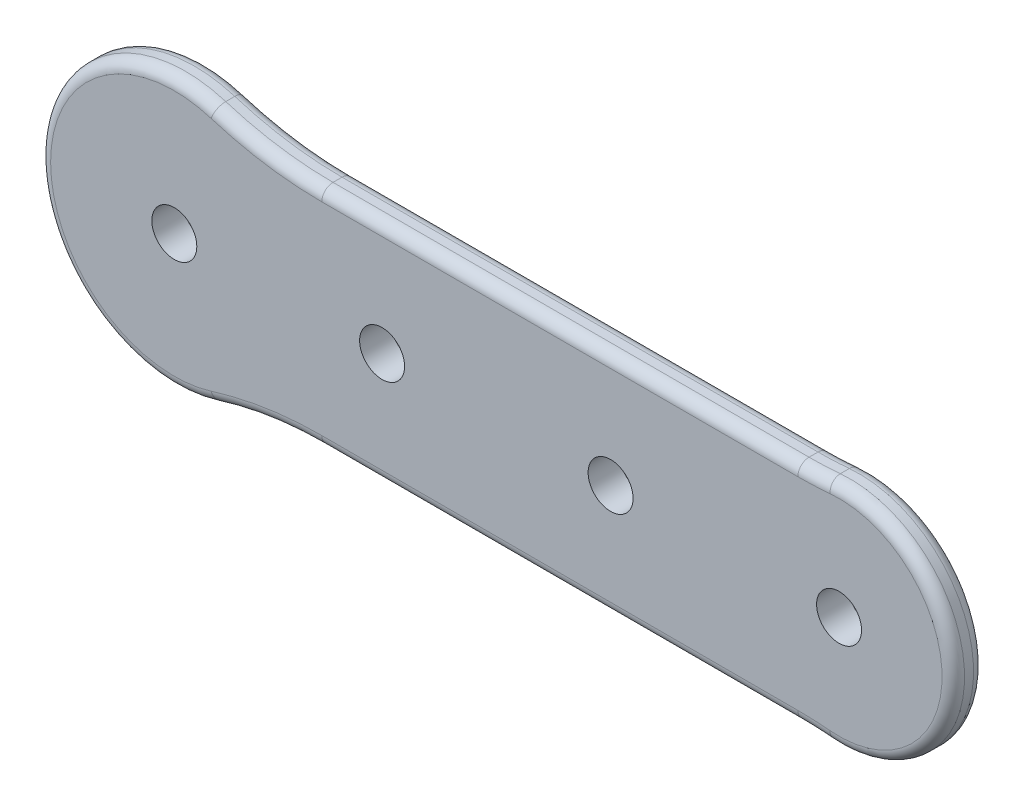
ISO-10303-21;
HEADER;
FILE_DESCRIPTION(('STEP AP214'),'2;1');
FILE_NAME('part.step','',(''),(''),'','','');
FILE_SCHEMA(('AUTOMOTIVE_DESIGN { 1 0 10303 214 1 1 1 1 }'));
ENDSEC;
DATA;
#1=APPLICATION_CONTEXT('core data for automotive mechanical design processes');
#2=APPLICATION_PROTOCOL_DEFINITION('international standard','automotive_design',2000,#1);
#3=PRODUCT_CONTEXT('',#1,'mechanical');
#4=PRODUCT('Part','Part','',(#3));
#5=PRODUCT_RELATED_PRODUCT_CATEGORY('part','',(#4));
#6=PRODUCT_DEFINITION_FORMATION('','',#4);
#7=PRODUCT_DEFINITION_CONTEXT('part definition',#1,'design');
#8=PRODUCT_DEFINITION('design','',#6,#7);
#9=PRODUCT_DEFINITION_SHAPE('','',#8);
#10=(LENGTH_UNIT() NAMED_UNIT(*) SI_UNIT(.MILLI.,.METRE.));
#11=(NAMED_UNIT(*) PLANE_ANGLE_UNIT() SI_UNIT($,.RADIAN.));
#12=(NAMED_UNIT(*) SI_UNIT($,.STERADIAN.) SOLID_ANGLE_UNIT());
#13=UNCERTAINTY_MEASURE_WITH_UNIT(LENGTH_MEASURE(1.E-05),#10,'distance_accuracy_value','');
#14=(GEOMETRIC_REPRESENTATION_CONTEXT(3) GLOBAL_UNCERTAINTY_ASSIGNED_CONTEXT((#13)) GLOBAL_UNIT_ASSIGNED_CONTEXT((#10,
#11,#12)) REPRESENTATION_CONTEXT('',''));
#15=CARTESIAN_POINT('',(0.,0.,0.));
#16=DIRECTION('',(0.,0.,1.));
#17=DIRECTION('',(1.,0.,0.));
#18=AXIS2_PLACEMENT_3D('',#15,#16,#17);
#19=CARTESIAN_POINT('',(-73.9,0.,7.));
#20=DIRECTION('',(0.,0.,-1.));
#21=DIRECTION('',(-1.,0.,0.));
#22=AXIS2_PLACEMENT_3D('',#19,#20,#21);
#23=CYLINDRICAL_SURFACE('',#22,30.);
#24=DIRECTION('',(0.,0.,-1.));
#25=VECTOR('',#24,1.);
#26=CARTESIAN_POINT('',(-64.9580383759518,-28.6363636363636,7.));
#27=LINE('',#26,#25);
#28=CARTESIAN_POINT('',(-64.9580383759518,-28.6363636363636,2.5));
#29=VERTEX_POINT('',#28);
#30=CARTESIAN_POINT('',(-64.9580383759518,-28.6363636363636,4.5));
#31=VERTEX_POINT('',#30);
#32=EDGE_CURVE('E183',#29,#31,#27,.F.);
#33=ORIENTED_EDGE('',*,*,#32,.T.);
#34=CARTESIAN_POINT('',(-73.9,0.,4.5));
#35=DIRECTION('',(0.,0.,1.));
#36=DIRECTION('',(1.,0.,0.));
#37=AXIS2_PLACEMENT_3D('',#34,#35,#36);
#38=CIRCLE('',#37,30.);
#39=CARTESIAN_POINT('',(-64.9580383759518,28.6363636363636,4.5));
#40=VERTEX_POINT('',#39);
#41=EDGE_CURVE('E209',#31,#40,#38,.F.);
#42=ORIENTED_EDGE('',*,*,#41,.T.);
#43=DIRECTION('',(0.,0.,-1.));
#44=VECTOR('',#43,1.);
#45=CARTESIAN_POINT('',(-64.9580383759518,28.6363636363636,7.));
#46=LINE('',#45,#44);
#47=CARTESIAN_POINT('',(-64.9580383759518,28.6363636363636,2.5));
#48=VERTEX_POINT('',#47);
#49=EDGE_CURVE('E186',#40,#48,#46,.T.);
#50=ORIENTED_EDGE('',*,*,#49,.T.);
#51=CARTESIAN_POINT('',(-73.9,0.,2.5));
#52=DIRECTION('',(0.,0.,1.));
#53=DIRECTION('',(1.,0.,0.));
#54=AXIS2_PLACEMENT_3D('',#51,#52,#53);
#55=CIRCLE('',#54,30.);
#56=EDGE_CURVE('E207',#48,#29,#55,.T.);
#57=ORIENTED_EDGE('',*,*,#56,.T.);
#58=EDGE_LOOP('',(#33,#42,#50,#57));
#59=FACE_BOUND('',#58,.T.);
#60=ADVANCED_FACE('F43',(#59),#23,.T.);
#61=CARTESIAN_POINT('',(0.,-25.,7.));
#62=DIRECTION('',(0.,1.,0.));
#63=DIRECTION('',(0.,0.,1.));
#64=AXIS2_PLACEMENT_3D('',#61,#62,#63);
#65=PLANE('',#64);
#66=DIRECTION('',(0.,0.,1.));
#67=VECTOR('',#66,1.);
#68=CARTESIAN_POINT('',(64.7261240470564,-25.,7.));
#69=LINE('',#68,#67);
#70=CARTESIAN_POINT('',(64.7261240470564,-25.,2.5));
#71=VERTEX_POINT('',#70);
#72=CARTESIAN_POINT('',(64.7261240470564,-25.,4.5));
#73=VERTEX_POINT('',#72);
#74=EDGE_CURVE('E300',#71,#73,#69,.T.);
#75=ORIENTED_EDGE('',*,*,#74,.T.);
#76=DIRECTION('',(1.,0.,0.));
#77=VECTOR('',#76,1.);
#78=CARTESIAN_POINT('',(-41.11280737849,-25.,4.5));
#79=LINE('',#78,#77);
#80=CARTESIAN_POINT('',(-41.11280737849,-25.,4.5));
#81=VERTEX_POINT('',#80);
#82=EDGE_CURVE('E217',#73,#81,#79,.F.);
#83=ORIENTED_EDGE('',*,*,#82,.T.);
#84=DIRECTION('',(0.,0.,1.));
#85=VECTOR('',#84,1.);
#86=CARTESIAN_POINT('',(-41.11280737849,-25.,0.));
#87=LINE('',#86,#85);
#88=CARTESIAN_POINT('',(-41.11280737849,-25.,2.5));
#89=VERTEX_POINT('',#88);
#90=EDGE_CURVE('E306',#81,#89,#87,.F.);
#91=ORIENTED_EDGE('',*,*,#90,.T.);
#92=DIRECTION('',(1.,0.,0.));
#93=VECTOR('',#92,1.);
#94=CARTESIAN_POINT('',(0.,-25.,2.5));
#95=LINE('',#94,#93);
#96=EDGE_CURVE('E215',#89,#71,#95,.T.);
#97=ORIENTED_EDGE('',*,*,#96,.T.);
#98=EDGE_LOOP('',(#75,#83,#91,#97));
#99=FACE_BOUND('',#98,.T.);
#100=ADVANCED_FACE('F364',(#99),#65,.F.);
#101=CARTESIAN_POINT('',(73.9,0.,7.));
#102=DIRECTION('',(0.,0.,-1.));
#103=DIRECTION('',(-1.,0.,0.));
#104=AXIS2_PLACEMENT_3D('',#101,#102,#103);
#105=CYLINDRICAL_SURFACE('',#104,25.4);
#106=DIRECTION('',(0.,0.,-1.));
#107=VECTOR('',#106,1.);
#108=CARTESIAN_POINT('',(71.6892177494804,25.303605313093,7.));
#109=LINE('',#108,#107);
#110=CARTESIAN_POINT('',(71.6892177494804,25.303605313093,2.5));
#111=VERTEX_POINT('',#110);
#112=CARTESIAN_POINT('',(71.6892177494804,25.303605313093,4.5));
#113=VERTEX_POINT('',#112);
#114=EDGE_CURVE('E307',#111,#113,#109,.F.);
#115=ORIENTED_EDGE('',*,*,#114,.T.);
#116=CARTESIAN_POINT('',(73.9,0.,4.5));
#117=DIRECTION('',(0.,0.,1.));
#118=DIRECTION('',(1.,0.,0.));
#119=AXIS2_PLACEMENT_3D('',#116,#117,#118);
#120=CIRCLE('',#119,25.4);
#121=CARTESIAN_POINT('',(71.6892177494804,-25.303605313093,4.5));
#122=VERTEX_POINT('',#121);
#123=EDGE_CURVE('E225',#113,#122,#120,.F.);
#124=ORIENTED_EDGE('',*,*,#123,.T.);
#125=DIRECTION('',(0.,0.,-1.));
#126=VECTOR('',#125,1.);
#127=CARTESIAN_POINT('',(71.6892177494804,-25.303605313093,7.));
#128=LINE('',#127,#126);
#129=CARTESIAN_POINT('',(71.6892177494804,-25.303605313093,2.5));
#130=VERTEX_POINT('',#129);
#131=EDGE_CURVE('E297',#122,#130,#128,.T.);
#132=ORIENTED_EDGE('',*,*,#131,.T.);
#133=CARTESIAN_POINT('',(73.9,0.,2.5));
#134=DIRECTION('',(0.,0.,1.));
#135=DIRECTION('',(1.,0.,0.));
#136=AXIS2_PLACEMENT_3D('',#133,#134,#135);
#137=CIRCLE('',#136,25.4);
#138=EDGE_CURVE('E223',#130,#111,#137,.T.);
#139=ORIENTED_EDGE('',*,*,#138,.T.);
#140=EDGE_LOOP('',(#115,#124,#132,#139));
#141=FACE_BOUND('',#140,.T.);
#142=ADVANCED_FACE('F303',(#141),#105,.T.);
#143=CARTESIAN_POINT('',(-27.7,0.,7.));
#144=DIRECTION('',(0.,0.,-1.));
#145=DIRECTION('',(-1.,0.,0.));
#146=AXIS2_PLACEMENT_3D('',#143,#144,#145);
#147=CYLINDRICAL_SURFACE('',#146,5.);
#148=CARTESIAN_POINT('',(-27.7,0.,7.));
#149=DIRECTION('',(0.,0.,1.));
#150=DIRECTION('',(1.,0.,0.));
#151=AXIS2_PLACEMENT_3D('',#148,#149,#150);
#152=CIRCLE('',#151,5.);
#153=CARTESIAN_POINT('',(-22.7,0.,7.));
#154=VERTEX_POINT('',#153);
#155=EDGE_CURVE('E656',#154,#154,#152,.T.);
#156=ORIENTED_EDGE('',*,*,#155,.T.);
#157=EDGE_LOOP('',(#156));
#158=FACE_BOUND('',#157,.T.);
#159=CARTESIAN_POINT('',(-27.7,0.,0.));
#160=DIRECTION('',(0.,0.,1.));
#161=DIRECTION('',(1.,0.,0.));
#162=AXIS2_PLACEMENT_3D('',#159,#160,#161);
#163=CIRCLE('',#162,5.);
#164=CARTESIAN_POINT('',(-22.7,0.,0.));
#165=VERTEX_POINT('',#164);
#166=EDGE_CURVE('E659',#165,#165,#163,.T.);
#167=ORIENTED_EDGE('',*,*,#166,.F.);
#168=EDGE_LOOP('',(#167));
#169=FACE_BOUND('',#168,.T.);
#170=ADVANCED_FACE('F592',(#158,#169),#147,.F.);
#171=CARTESIAN_POINT('',(-73.9,0.,7.));
#172=DIRECTION('',(0.,0.,-1.));
#173=DIRECTION('',(-1.,0.,0.));
#174=AXIS2_PLACEMENT_3D('',#171,#172,#173);
#175=CYLINDRICAL_SURFACE('',#174,5.);
#176=CARTESIAN_POINT('',(-73.9,0.,7.));
#177=DIRECTION('',(0.,0.,1.));
#178=DIRECTION('',(1.,0.,0.));
#179=AXIS2_PLACEMENT_3D('',#176,#177,#178);
#180=CIRCLE('',#179,5.);
#181=CARTESIAN_POINT('',(-68.9,0.,7.));
#182=VERTEX_POINT('',#181);
#183=EDGE_CURVE('E674',#182,#182,#180,.T.);
#184=ORIENTED_EDGE('',*,*,#183,.T.);
#185=EDGE_LOOP('',(#184));
#186=FACE_BOUND('',#185,.T.);
#187=CARTESIAN_POINT('',(-73.9,0.,0.));
#188=DIRECTION('',(0.,0.,1.));
#189=DIRECTION('',(1.,0.,0.));
#190=AXIS2_PLACEMENT_3D('',#187,#188,#189);
#191=CIRCLE('',#190,5.);
#192=CARTESIAN_POINT('',(-68.9,0.,0.));
#193=VERTEX_POINT('',#192);
#194=EDGE_CURVE('E662',#193,#193,#191,.T.);
#195=ORIENTED_EDGE('',*,*,#194,.F.);
#196=EDGE_LOOP('',(#195));
#197=FACE_BOUND('',#196,.T.);
#198=ADVANCED_FACE('F583',(#186,#197),#175,.F.);
#199=CARTESIAN_POINT('',(0.,25.,7.));
#200=DIRECTION('',(0.,1.,0.));
#201=DIRECTION('',(0.,0.,1.));
#202=AXIS2_PLACEMENT_3D('',#199,#200,#201);
#203=PLANE('',#202);
#204=DIRECTION('',(0.,0.,-1.));
#205=VECTOR('',#204,1.);
#206=CARTESIAN_POINT('',(-41.11280737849,25.,7.));
#207=LINE('',#206,#205);
#208=CARTESIAN_POINT('',(-41.11280737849,25.,2.5));
#209=VERTEX_POINT('',#208);
#210=CARTESIAN_POINT('',(-41.11280737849,25.,4.5));
#211=VERTEX_POINT('',#210);
#212=EDGE_CURVE('E316',#209,#211,#207,.F.);
#213=ORIENTED_EDGE('',*,*,#212,.T.);
#214=DIRECTION('',(1.,0.,0.));
#215=VECTOR('',#214,1.);
#216=CARTESIAN_POINT('',(0.,25.,4.5));
#217=LINE('',#216,#215);
#218=CARTESIAN_POINT('',(64.7261240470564,25.,4.5));
#219=VERTEX_POINT('',#218);
#220=EDGE_CURVE('E11',#211,#219,#217,.T.);
#221=ORIENTED_EDGE('',*,*,#220,.T.);
#222=DIRECTION('',(0.,0.,-1.));
#223=VECTOR('',#222,1.);
#224=CARTESIAN_POINT('',(64.7261240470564,25.,7.));
#225=LINE('',#224,#223);
#226=CARTESIAN_POINT('',(64.7261240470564,25.,2.5));
#227=VERTEX_POINT('',#226);
#228=EDGE_CURVE('E319',#219,#227,#225,.T.);
#229=ORIENTED_EDGE('',*,*,#228,.T.);
#230=DIRECTION('',(1.,0.,0.));
#231=VECTOR('',#230,1.);
#232=CARTESIAN_POINT('',(-41.11280737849,25.,2.5));
#233=LINE('',#232,#231);
#234=EDGE_CURVE('E52',#227,#209,#233,.F.);
#235=ORIENTED_EDGE('',*,*,#234,.T.);
#236=EDGE_LOOP('',(#213,#221,#229,#235));
#237=FACE_BOUND('',#236,.T.);
#238=ADVANCED_FACE('F378',(#237),#203,.T.);
#239=CARTESIAN_POINT('',(73.9,0.,7.));
#240=DIRECTION('',(0.,0.,-1.));
#241=DIRECTION('',(-1.,0.,0.));
#242=AXIS2_PLACEMENT_3D('',#239,#240,#241);
#243=CYLINDRICAL_SURFACE('',#242,5.);
#244=CARTESIAN_POINT('',(73.9,0.,7.));
#245=DIRECTION('',(0.,0.,1.));
#246=DIRECTION('',(1.,0.,0.));
#247=AXIS2_PLACEMENT_3D('',#244,#245,#246);
#248=CIRCLE('',#247,5.);
#249=CARTESIAN_POINT('',(78.9,0.,7.));
#250=VERTEX_POINT('',#249);
#251=EDGE_CURVE('E665',#250,#250,#248,.T.);
#252=ORIENTED_EDGE('',*,*,#251,.T.);
#253=EDGE_LOOP('',(#252));
#254=FACE_BOUND('',#253,.T.);
#255=CARTESIAN_POINT('',(73.9,0.,0.));
#256=DIRECTION('',(0.,0.,1.));
#257=DIRECTION('',(1.,0.,0.));
#258=AXIS2_PLACEMENT_3D('',#255,#256,#257);
#259=CIRCLE('',#258,5.);
#260=CARTESIAN_POINT('',(78.9,0.,0.));
#261=VERTEX_POINT('',#260);
#262=EDGE_CURVE('E260',#261,#261,#259,.T.);
#263=ORIENTED_EDGE('',*,*,#262,.F.);
#264=EDGE_LOOP('',(#263));
#265=FACE_BOUND('',#264,.T.);
#266=ADVANCED_FACE('F374',(#254,#265),#243,.F.);
#267=CARTESIAN_POINT('',(23.1,0.,7.));
#268=DIRECTION('',(0.,0.,-1.));
#269=DIRECTION('',(-1.,0.,0.));
#270=AXIS2_PLACEMENT_3D('',#267,#268,#269);
#271=CYLINDRICAL_SURFACE('',#270,5.);
#272=CARTESIAN_POINT('',(23.1,0.,7.));
#273=DIRECTION('',(0.,0.,1.));
#274=DIRECTION('',(1.,0.,0.));
#275=AXIS2_PLACEMENT_3D('',#272,#273,#274);
#276=CIRCLE('',#275,5.);
#277=CARTESIAN_POINT('',(28.1,0.,7.));
#278=VERTEX_POINT('',#277);
#279=EDGE_CURVE('E311',#278,#278,#276,.T.);
#280=ORIENTED_EDGE('',*,*,#279,.T.);
#281=EDGE_LOOP('',(#280));
#282=FACE_BOUND('',#281,.T.);
#283=CARTESIAN_POINT('',(23.1,0.,0.));
#284=DIRECTION('',(0.,0.,1.));
#285=DIRECTION('',(1.,0.,0.));
#286=AXIS2_PLACEMENT_3D('',#283,#284,#285);
#287=CIRCLE('',#286,5.);
#288=CARTESIAN_POINT('',(28.1,0.,0.));
#289=VERTEX_POINT('',#288);
#290=EDGE_CURVE('E661',#289,#289,#287,.T.);
#291=ORIENTED_EDGE('',*,*,#290,.F.);
#292=EDGE_LOOP('',(#291));
#293=FACE_BOUND('',#292,.T.);
#294=ADVANCED_FACE('F377',(#282,#293),#271,.F.);
#295=CARTESIAN_POINT('',(0.,0.,7.));
#296=DIRECTION('',(0.,0.,1.));
#297=DIRECTION('',(1.,0.,0.));
#298=AXIS2_PLACEMENT_3D('',#295,#296,#297);
#299=PLANE('',#298);
#300=DIRECTION('',(1.,0.,0.));
#301=VECTOR('',#300,1.);
#302=CARTESIAN_POINT('',(0.,22.5,7.));
#303=LINE('',#302,#301);
#304=CARTESIAN_POINT('',(64.7261240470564,22.5,7.));
#305=VERTEX_POINT('',#304);
#306=CARTESIAN_POINT('',(-41.11280737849,22.5,7.));
#307=VERTEX_POINT('',#306);
#308=EDGE_CURVE('E162',#305,#307,#303,.F.);
#309=ORIENTED_EDGE('',*,*,#308,.T.);
#310=CARTESIAN_POINT('',(-41.11280737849,105.,7.));
#311=DIRECTION('',(0.,0.,1.));
#312=DIRECTION('',(1.,0.,0.));
#313=AXIS2_PLACEMENT_3D('',#310,#311,#312);
#314=CIRCLE('',#313,82.5);
#315=CARTESIAN_POINT('',(-65.7032018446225,26.25,7.));
#316=VERTEX_POINT('',#315);
#317=EDGE_CURVE('E199',#307,#316,#314,.F.);
#318=ORIENTED_EDGE('',*,*,#317,.T.);
#319=CARTESIAN_POINT('',(-73.9,0.,7.));
#320=DIRECTION('',(0.,0.,1.));
#321=DIRECTION('',(1.,0.,0.));
#322=AXIS2_PLACEMENT_3D('',#319,#320,#321);
#323=CIRCLE('',#322,27.5);
#324=CARTESIAN_POINT('',(-65.7032018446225,-26.25,7.));
#325=VERTEX_POINT('',#324);
#326=EDGE_CURVE('E197',#316,#325,#323,.T.);
#327=ORIENTED_EDGE('',*,*,#326,.T.);
#328=CARTESIAN_POINT('',(-41.11280737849,-105.,7.));
#329=DIRECTION('',(0.,0.,1.));
#330=DIRECTION('',(1.,0.,0.));
#331=AXIS2_PLACEMENT_3D('',#328,#329,#330);
#332=CIRCLE('',#331,82.5);
#333=CARTESIAN_POINT('',(-41.11280737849,-22.5,7.));
#334=VERTEX_POINT('',#333);
#335=EDGE_CURVE('E195',#325,#334,#332,.F.);
#336=ORIENTED_EDGE('',*,*,#335,.T.);
#337=DIRECTION('',(1.,0.,0.));
#338=VECTOR('',#337,1.);
#339=CARTESIAN_POINT('',(64.7261240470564,-22.5,7.));
#340=LINE('',#339,#338);
#341=CARTESIAN_POINT('',(64.7261240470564,-22.5,7.));
#342=VERTEX_POINT('',#341);
#343=EDGE_CURVE('E193',#334,#342,#340,.T.);
#344=ORIENTED_EDGE('',*,*,#343,.T.);
#345=CARTESIAN_POINT('',(64.7261240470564,-105.,7.));
#346=DIRECTION('',(0.,0.,1.));
#347=DIRECTION('',(1.,0.,0.));
#348=AXIS2_PLACEMENT_3D('',#345,#346,#347);
#349=CIRCLE('',#348,82.5);
#350=CARTESIAN_POINT('',(71.9068144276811,-22.8130929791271,7.));
#351=VERTEX_POINT('',#350);
#352=EDGE_CURVE('E191',#342,#351,#349,.F.);
#353=ORIENTED_EDGE('',*,*,#352,.T.);
#354=CARTESIAN_POINT('',(73.9,0.,7.));
#355=DIRECTION('',(0.,0.,1.));
#356=DIRECTION('',(1.,0.,0.));
#357=AXIS2_PLACEMENT_3D('',#354,#355,#356);
#358=CIRCLE('',#357,22.9);
#359=CARTESIAN_POINT('',(71.9068144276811,22.8130929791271,7.));
#360=VERTEX_POINT('',#359);
#361=EDGE_CURVE('E165',#351,#360,#358,.T.);
#362=ORIENTED_EDGE('',*,*,#361,.T.);
#363=CARTESIAN_POINT('',(64.7261240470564,105.,7.));
#364=DIRECTION('',(0.,0.,1.));
#365=DIRECTION('',(1.,0.,0.));
#366=AXIS2_PLACEMENT_3D('',#363,#364,#365);
#367=CIRCLE('',#366,82.5);
#368=EDGE_CURVE('E156',#360,#305,#367,.F.);
#369=ORIENTED_EDGE('',*,*,#368,.T.);
#370=EDGE_LOOP('',(#309,#318,#327,#336,#344,#353,#362,#369));
#371=FACE_BOUND('',#370,.T.);
#372=ORIENTED_EDGE('',*,*,#251,.F.);
#373=EDGE_LOOP('',(#372));
#374=FACE_BOUND('',#373,.T.);
#375=ORIENTED_EDGE('',*,*,#183,.F.);
#376=EDGE_LOOP('',(#375));
#377=FACE_BOUND('',#376,.T.);
#378=ORIENTED_EDGE('',*,*,#155,.F.);
#379=EDGE_LOOP('',(#378));
#380=FACE_BOUND('',#379,.T.);
#381=ORIENTED_EDGE('',*,*,#279,.F.);
#382=EDGE_LOOP('',(#381));
#383=FACE_BOUND('',#382,.T.);
#384=ADVANCED_FACE('F158',(#371,#374,#377,#380,#383),#299,.T.);
#385=CARTESIAN_POINT('',(0.,0.,0.));
#386=DIRECTION('',(0.,0.,1.));
#387=DIRECTION('',(1.,0.,0.));
#388=AXIS2_PLACEMENT_3D('',#385,#386,#387);
#389=PLANE('',#388);
#390=CARTESIAN_POINT('',(-73.9,0.,0.));
#391=DIRECTION('',(0.,0.,1.));
#392=DIRECTION('',(1.,0.,0.));
#393=AXIS2_PLACEMENT_3D('',#390,#391,#392);
#394=CIRCLE('',#393,27.5);
#395=CARTESIAN_POINT('',(-65.7032018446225,-26.25,0.));
#396=VERTEX_POINT('',#395);
#397=CARTESIAN_POINT('',(-65.7032018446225,26.25,0.));
#398=VERTEX_POINT('',#397);
#399=EDGE_CURVE('E60',#396,#398,#394,.F.);
#400=ORIENTED_EDGE('',*,*,#399,.T.);
#401=CARTESIAN_POINT('',(-41.11280737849,105.,0.));
#402=DIRECTION('',(0.,0.,1.));
#403=DIRECTION('',(1.,0.,0.));
#404=AXIS2_PLACEMENT_3D('',#401,#402,#403);
#405=CIRCLE('',#404,82.5);
#406=CARTESIAN_POINT('',(-41.11280737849,22.5,0.));
#407=VERTEX_POINT('',#406);
#408=EDGE_CURVE('E242',#398,#407,#405,.T.);
#409=ORIENTED_EDGE('',*,*,#408,.T.);
#410=DIRECTION('',(1.,0.,0.));
#411=VECTOR('',#410,1.);
#412=CARTESIAN_POINT('',(64.7261240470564,22.5,0.));
#413=LINE('',#412,#411);
#414=CARTESIAN_POINT('',(64.7261240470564,22.5,0.));
#415=VERTEX_POINT('',#414);
#416=EDGE_CURVE('E230',#407,#415,#413,.T.);
#417=ORIENTED_EDGE('',*,*,#416,.T.);
#418=CARTESIAN_POINT('',(64.7261240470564,105.,0.));
#419=DIRECTION('',(0.,0.,1.));
#420=DIRECTION('',(1.,0.,0.));
#421=AXIS2_PLACEMENT_3D('',#418,#419,#420);
#422=CIRCLE('',#421,82.5);
#423=CARTESIAN_POINT('',(71.9068144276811,22.8130929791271,0.));
#424=VERTEX_POINT('',#423);
#425=EDGE_CURVE('E232',#415,#424,#422,.T.);
#426=ORIENTED_EDGE('',*,*,#425,.T.);
#427=CARTESIAN_POINT('',(73.9,0.,0.));
#428=DIRECTION('',(0.,0.,1.));
#429=DIRECTION('',(1.,0.,0.));
#430=AXIS2_PLACEMENT_3D('',#427,#428,#429);
#431=CIRCLE('',#430,22.9);
#432=CARTESIAN_POINT('',(71.9068144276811,-22.8130929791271,0.));
#433=VERTEX_POINT('',#432);
#434=EDGE_CURVE('E234',#424,#433,#431,.F.);
#435=ORIENTED_EDGE('',*,*,#434,.T.);
#436=CARTESIAN_POINT('',(64.7261240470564,-105.,0.));
#437=DIRECTION('',(0.,0.,1.));
#438=DIRECTION('',(1.,0.,0.));
#439=AXIS2_PLACEMENT_3D('',#436,#437,#438);
#440=CIRCLE('',#439,82.5);
#441=CARTESIAN_POINT('',(64.7261240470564,-22.5,0.));
#442=VERTEX_POINT('',#441);
#443=EDGE_CURVE('E236',#433,#442,#440,.T.);
#444=ORIENTED_EDGE('',*,*,#443,.T.);
#445=DIRECTION('',(1.,0.,0.));
#446=VECTOR('',#445,1.);
#447=CARTESIAN_POINT('',(0.,-22.5,0.));
#448=LINE('',#447,#446);
#449=CARTESIAN_POINT('',(-41.11280737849,-22.5,0.));
#450=VERTEX_POINT('',#449);
#451=EDGE_CURVE('E238',#442,#450,#448,.F.);
#452=ORIENTED_EDGE('',*,*,#451,.T.);
#453=CARTESIAN_POINT('',(-41.11280737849,-105.,0.));
#454=DIRECTION('',(0.,0.,1.));
#455=DIRECTION('',(1.,0.,0.));
#456=AXIS2_PLACEMENT_3D('',#453,#454,#455);
#457=CIRCLE('',#456,82.5);
#458=EDGE_CURVE('E65',#450,#396,#457,.T.);
#459=ORIENTED_EDGE('',*,*,#458,.T.);
#460=EDGE_LOOP('',(#400,#409,#417,#426,#435,#444,#452,#459));
#461=FACE_BOUND('',#460,.T.);
#462=ORIENTED_EDGE('',*,*,#262,.T.);
#463=EDGE_LOOP('',(#462));
#464=FACE_BOUND('',#463,.T.);
#465=ORIENTED_EDGE('',*,*,#194,.T.);
#466=EDGE_LOOP('',(#465));
#467=FACE_BOUND('',#466,.T.);
#468=ORIENTED_EDGE('',*,*,#166,.T.);
#469=EDGE_LOOP('',(#468));
#470=FACE_BOUND('',#469,.T.);
#471=ORIENTED_EDGE('',*,*,#290,.T.);
#472=EDGE_LOOP('',(#471));
#473=FACE_BOUND('',#472,.T.);
#474=ADVANCED_FACE('F383',(#461,#464,#467,#470,#473),#389,.F.);
#475=CARTESIAN_POINT('',(64.7261240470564,-105.,7.));
#476=DIRECTION('',(0.,0.,-1.));
#477=DIRECTION('',(-1.,0.,0.));
#478=AXIS2_PLACEMENT_3D('',#475,#476,#477);
#479=CYLINDRICAL_SURFACE('',#478,80.);
#480=ORIENTED_EDGE('',*,*,#131,.F.);
#481=CARTESIAN_POINT('',(64.7261240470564,-105.,4.5));
#482=DIRECTION('',(0.,0.,1.));
#483=DIRECTION('',(1.,0.,0.));
#484=AXIS2_PLACEMENT_3D('',#481,#482,#483);
#485=CIRCLE('',#484,80.);
#486=EDGE_CURVE('E221',#122,#73,#485,.T.);
#487=ORIENTED_EDGE('',*,*,#486,.T.);
#488=ORIENTED_EDGE('',*,*,#74,.F.);
#489=CARTESIAN_POINT('',(64.7261240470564,-105.,2.5));
#490=DIRECTION('',(0.,0.,1.));
#491=DIRECTION('',(1.,0.,0.));
#492=AXIS2_PLACEMENT_3D('',#489,#490,#491);
#493=CIRCLE('',#492,80.);
#494=EDGE_CURVE('E219',#71,#130,#493,.F.);
#495=ORIENTED_EDGE('',*,*,#494,.T.);
#496=EDGE_LOOP('',(#480,#487,#488,#495));
#497=FACE_BOUND('',#496,.T.);
#498=ADVANCED_FACE('F296',(#497),#479,.F.);
#499=CARTESIAN_POINT('',(64.7261240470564,105.,7.));
#500=DIRECTION('',(0.,0.,-1.));
#501=DIRECTION('',(-1.,0.,0.));
#502=AXIS2_PLACEMENT_3D('',#499,#500,#501);
#503=CYLINDRICAL_SURFACE('',#502,80.);
#504=ORIENTED_EDGE('',*,*,#228,.F.);
#505=CARTESIAN_POINT('',(64.7261240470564,105.,4.5));
#506=DIRECTION('',(0.,0.,1.));
#507=DIRECTION('',(1.,0.,0.));
#508=AXIS2_PLACEMENT_3D('',#505,#506,#507);
#509=CIRCLE('',#508,80.);
#510=EDGE_CURVE('E174',#219,#113,#509,.T.);
#511=ORIENTED_EDGE('',*,*,#510,.T.);
#512=ORIENTED_EDGE('',*,*,#114,.F.);
#513=CARTESIAN_POINT('',(64.7261240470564,105.,2.5));
#514=DIRECTION('',(0.,0.,1.));
#515=DIRECTION('',(1.,0.,0.));
#516=AXIS2_PLACEMENT_3D('',#513,#514,#515);
#517=CIRCLE('',#516,80.);
#518=EDGE_CURVE('E227',#111,#227,#517,.F.);
#519=ORIENTED_EDGE('',*,*,#518,.T.);
#520=EDGE_LOOP('',(#504,#511,#512,#519));
#521=FACE_BOUND('',#520,.T.);
#522=ADVANCED_FACE('F382',(#521),#503,.F.);
#523=CARTESIAN_POINT('',(-41.11280737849,-105.,7.));
#524=DIRECTION('',(0.,0.,-1.));
#525=DIRECTION('',(-1.,0.,0.));
#526=AXIS2_PLACEMENT_3D('',#523,#524,#525);
#527=CYLINDRICAL_SURFACE('',#526,80.);
#528=ORIENTED_EDGE('',*,*,#90,.F.);
#529=CARTESIAN_POINT('',(-41.11280737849,-105.,4.5));
#530=DIRECTION('',(0.,0.,1.));
#531=DIRECTION('',(1.,0.,0.));
#532=AXIS2_PLACEMENT_3D('',#529,#530,#531);
#533=CIRCLE('',#532,80.);
#534=EDGE_CURVE('E213',#81,#31,#533,.T.);
#535=ORIENTED_EDGE('',*,*,#534,.T.);
#536=ORIENTED_EDGE('',*,*,#32,.F.);
#537=CARTESIAN_POINT('',(-41.11280737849,-105.,2.5));
#538=DIRECTION('',(0.,0.,1.));
#539=DIRECTION('',(1.,0.,0.));
#540=AXIS2_PLACEMENT_3D('',#537,#538,#539);
#541=CIRCLE('',#540,80.);
#542=EDGE_CURVE('E211',#29,#89,#541,.F.);
#543=ORIENTED_EDGE('',*,*,#542,.T.);
#544=EDGE_LOOP('',(#528,#535,#536,#543));
#545=FACE_BOUND('',#544,.T.);
#546=ADVANCED_FACE('F386',(#545),#527,.F.);
#547=CARTESIAN_POINT('',(-41.11280737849,105.,7.));
#548=DIRECTION('',(0.,0.,-1.));
#549=DIRECTION('',(-1.,0.,0.));
#550=AXIS2_PLACEMENT_3D('',#547,#548,#549);
#551=CYLINDRICAL_SURFACE('',#550,80.);
#552=ORIENTED_EDGE('',*,*,#49,.F.);
#553=CARTESIAN_POINT('',(-41.11280737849,105.,4.5));
#554=DIRECTION('',(0.,0.,1.));
#555=DIRECTION('',(1.,0.,0.));
#556=AXIS2_PLACEMENT_3D('',#553,#554,#555);
#557=CIRCLE('',#556,80.);
#558=EDGE_CURVE('E204',#40,#211,#557,.T.);
#559=ORIENTED_EDGE('',*,*,#558,.T.);
#560=ORIENTED_EDGE('',*,*,#212,.F.);
#561=CARTESIAN_POINT('',(-41.11280737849,105.,2.5));
#562=DIRECTION('',(0.,0.,1.));
#563=DIRECTION('',(1.,0.,0.));
#564=AXIS2_PLACEMENT_3D('',#561,#562,#563);
#565=CIRCLE('',#564,80.);
#566=EDGE_CURVE('E201',#209,#48,#565,.F.);
#567=ORIENTED_EDGE('',*,*,#566,.T.);
#568=EDGE_LOOP('',(#552,#559,#560,#567));
#569=FACE_BOUND('',#568,.T.);
#570=ADVANCED_FACE('F329',(#569),#551,.F.);
#571=CARTESIAN_POINT('',(64.7261240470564,-105.,4.5));
#572=DIRECTION('',(0.,0.,1.));
#573=DIRECTION('',(1.,0.,0.));
#574=AXIS2_PLACEMENT_3D('',#571,#572,#573);
#575=TOROIDAL_SURFACE('',#574,82.5,2.5);
#576=CARTESIAN_POINT('',(64.7261240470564,-22.5,4.5));
#577=DIRECTION('',(-1.,0.,0.));
#578=DIRECTION('',(0.,0.,1.));
#579=AXIS2_PLACEMENT_3D('',#576,#577,#578);
#580=CIRCLE('',#579,2.5);
#581=EDGE_CURVE('E254',#73,#342,#580,.T.);
#582=ORIENTED_EDGE('',*,*,#581,.F.);
#583=ORIENTED_EDGE('',*,*,#486,.F.);
#584=CARTESIAN_POINT('',(71.9068144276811,-22.8130929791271,4.5));
#585=DIRECTION('',(0.996204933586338,-0.0870386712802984,0.));
#586=DIRECTION('',(0.0870386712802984,0.996204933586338,0.));
#587=AXIS2_PLACEMENT_3D('',#584,#585,#586);
#588=CIRCLE('',#587,2.5);
#589=EDGE_CURVE('E257',#351,#122,#588,.T.);
#590=ORIENTED_EDGE('',*,*,#589,.F.);
#591=ORIENTED_EDGE('',*,*,#352,.F.);
#592=EDGE_LOOP('',(#582,#583,#590,#591));
#593=FACE_BOUND('',#592,.T.);
#594=ADVANCED_FACE('F352',(#593),#575,.T.);
#595=CARTESIAN_POINT('',(73.9,0.,4.5));
#596=DIRECTION('',(0.,0.,1.));
#597=DIRECTION('',(1.,0.,0.));
#598=AXIS2_PLACEMENT_3D('',#595,#596,#597);
#599=TOROIDAL_SURFACE('',#598,22.9,2.5);
#600=ORIENTED_EDGE('',*,*,#589,.T.);
#601=ORIENTED_EDGE('',*,*,#123,.F.);
#602=CARTESIAN_POINT('',(71.9068144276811,22.8130929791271,4.5));
#603=DIRECTION('',(-0.996204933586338,-0.0870386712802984,0.));
#604=DIRECTION('',(0.0870386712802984,-0.996204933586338,0.));
#605=AXIS2_PLACEMENT_3D('',#602,#603,#604);
#606=CIRCLE('',#605,2.5);
#607=EDGE_CURVE('E252',#360,#113,#606,.T.);
#608=ORIENTED_EDGE('',*,*,#607,.F.);
#609=ORIENTED_EDGE('',*,*,#361,.F.);
#610=EDGE_LOOP('',(#600,#601,#608,#609));
#611=FACE_BOUND('',#610,.T.);
#612=ADVANCED_FACE('F354',(#611),#599,.T.);
#613=CARTESIAN_POINT('',(0.,-22.5,4.5));
#614=DIRECTION('',(-1.,0.,0.));
#615=DIRECTION('',(0.,0.,1.));
#616=AXIS2_PLACEMENT_3D('',#613,#614,#615);
#617=CYLINDRICAL_SURFACE('',#616,2.5);
#618=ORIENTED_EDGE('',*,*,#581,.T.);
#619=ORIENTED_EDGE('',*,*,#343,.F.);
#620=CARTESIAN_POINT('',(-41.11280737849,-22.5,4.5));
#621=DIRECTION('',(-1.,0.,0.));
#622=DIRECTION('',(0.,0.,1.));
#623=AXIS2_PLACEMENT_3D('',#620,#621,#622);
#624=CIRCLE('',#623,2.5);
#625=EDGE_CURVE('E177',#81,#334,#624,.T.);
#626=ORIENTED_EDGE('',*,*,#625,.F.);
#627=ORIENTED_EDGE('',*,*,#82,.F.);
#628=EDGE_LOOP('',(#618,#619,#626,#627));
#629=FACE_BOUND('',#628,.T.);
#630=ADVANCED_FACE('F347',(#629),#617,.T.);
#631=CARTESIAN_POINT('',(64.7261240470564,105.,4.5));
#632=DIRECTION('',(0.,0.,1.));
#633=DIRECTION('',(1.,0.,0.));
#634=AXIS2_PLACEMENT_3D('',#631,#632,#633);
#635=TOROIDAL_SURFACE('',#634,82.5,2.5);
#636=ORIENTED_EDGE('',*,*,#607,.T.);
#637=ORIENTED_EDGE('',*,*,#510,.F.);
#638=CARTESIAN_POINT('',(64.7261240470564,22.5,4.5));
#639=DIRECTION('',(-1.,0.,0.));
#640=DIRECTION('',(0.,0.,1.));
#641=AXIS2_PLACEMENT_3D('',#638,#639,#640);
#642=CIRCLE('',#641,2.5);
#643=EDGE_CURVE('E172',#305,#219,#642,.T.);
#644=ORIENTED_EDGE('',*,*,#643,.F.);
#645=ORIENTED_EDGE('',*,*,#368,.F.);
#646=EDGE_LOOP('',(#636,#637,#644,#645));
#647=FACE_BOUND('',#646,.T.);
#648=ADVANCED_FACE('F173',(#647),#635,.T.);
#649=CARTESIAN_POINT('',(-41.11280737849,-105.,4.5));
#650=DIRECTION('',(0.,0.,1.));
#651=DIRECTION('',(1.,0.,0.));
#652=AXIS2_PLACEMENT_3D('',#649,#650,#651);
#653=TOROIDAL_SURFACE('',#652,82.5,2.5);
#654=ORIENTED_EDGE('',*,*,#625,.T.);
#655=ORIENTED_EDGE('',*,*,#335,.F.);
#656=CARTESIAN_POINT('',(-65.7032018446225,-26.25,4.5));
#657=DIRECTION('',(-0.954545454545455,-0.298065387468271,0.));
#658=DIRECTION('',(0.298065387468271,-0.954545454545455,0.));
#659=AXIS2_PLACEMENT_3D('',#656,#657,#658);
#660=CIRCLE('',#659,2.5);
#661=EDGE_CURVE('E178',#31,#325,#660,.T.);
#662=ORIENTED_EDGE('',*,*,#661,.F.);
#663=ORIENTED_EDGE('',*,*,#534,.F.);
#664=EDGE_LOOP('',(#654,#655,#662,#663));
#665=FACE_BOUND('',#664,.T.);
#666=ADVANCED_FACE('F342',(#665),#653,.T.);
#667=CARTESIAN_POINT('',(0.,22.5,4.5));
#668=DIRECTION('',(1.,0.,0.));
#669=DIRECTION('',(0.,0.,-1.));
#670=AXIS2_PLACEMENT_3D('',#667,#668,#669);
#671=CYLINDRICAL_SURFACE('',#670,2.5);
#672=ORIENTED_EDGE('',*,*,#643,.T.);
#673=ORIENTED_EDGE('',*,*,#220,.F.);
#674=CARTESIAN_POINT('',(-41.11280737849,22.5,4.5));
#675=DIRECTION('',(-1.,0.,0.));
#676=DIRECTION('',(0.,0.,1.));
#677=AXIS2_PLACEMENT_3D('',#674,#675,#676);
#678=CIRCLE('',#677,2.5);
#679=EDGE_CURVE('E181',#307,#211,#678,.T.);
#680=ORIENTED_EDGE('',*,*,#679,.F.);
#681=ORIENTED_EDGE('',*,*,#308,.F.);
#682=EDGE_LOOP('',(#672,#673,#680,#681));
#683=FACE_BOUND('',#682,.T.);
#684=ADVANCED_FACE('F180',(#683),#671,.T.);
#685=CARTESIAN_POINT('',(-73.9,0.,4.5));
#686=DIRECTION('',(0.,0.,1.));
#687=DIRECTION('',(1.,0.,0.));
#688=AXIS2_PLACEMENT_3D('',#685,#686,#687);
#689=TOROIDAL_SURFACE('',#688,27.5,2.5);
#690=ORIENTED_EDGE('',*,*,#661,.T.);
#691=ORIENTED_EDGE('',*,*,#326,.F.);
#692=CARTESIAN_POINT('',(-65.7032018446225,26.25,4.5));
#693=DIRECTION('',(0.954545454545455,-0.298065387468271,0.));
#694=DIRECTION('',(0.298065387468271,0.954545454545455,0.));
#695=AXIS2_PLACEMENT_3D('',#692,#693,#694);
#696=CIRCLE('',#695,2.5);
#697=EDGE_CURVE('E245',#40,#316,#696,.T.);
#698=ORIENTED_EDGE('',*,*,#697,.F.);
#699=ORIENTED_EDGE('',*,*,#41,.F.);
#700=EDGE_LOOP('',(#690,#691,#698,#699));
#701=FACE_BOUND('',#700,.T.);
#702=ADVANCED_FACE('F337',(#701),#689,.T.);
#703=CARTESIAN_POINT('',(-41.11280737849,105.,4.5));
#704=DIRECTION('',(0.,0.,1.));
#705=DIRECTION('',(1.,0.,0.));
#706=AXIS2_PLACEMENT_3D('',#703,#704,#705);
#707=TOROIDAL_SURFACE('',#706,82.5,2.5);
#708=ORIENTED_EDGE('',*,*,#679,.T.);
#709=ORIENTED_EDGE('',*,*,#558,.F.);
#710=ORIENTED_EDGE('',*,*,#697,.T.);
#711=ORIENTED_EDGE('',*,*,#317,.F.);
#712=EDGE_LOOP('',(#708,#709,#710,#711));
#713=FACE_BOUND('',#712,.T.);
#714=ADVANCED_FACE('F334',(#713),#707,.T.);
#715=CARTESIAN_POINT('',(64.7261240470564,-105.,2.5));
#716=DIRECTION('',(0.,0.,1.));
#717=DIRECTION('',(1.,0.,0.));
#718=AXIS2_PLACEMENT_3D('',#715,#716,#717);
#719=TOROIDAL_SURFACE('',#718,82.5,2.5);
#720=CARTESIAN_POINT('',(71.9068144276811,-22.8130929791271,2.5));
#721=DIRECTION('',(0.996204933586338,-0.0870386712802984,0.));
#722=DIRECTION('',(0.0870386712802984,0.996204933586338,0.));
#723=AXIS2_PLACEMENT_3D('',#720,#721,#722);
#724=CIRCLE('',#723,2.5);
#725=EDGE_CURVE('E276',#130,#433,#724,.T.);
#726=ORIENTED_EDGE('',*,*,#725,.F.);
#727=ORIENTED_EDGE('',*,*,#494,.F.);
#728=CARTESIAN_POINT('',(64.7261240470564,-22.5,2.5));
#729=DIRECTION('',(-1.,0.,0.));
#730=DIRECTION('',(0.,0.,1.));
#731=AXIS2_PLACEMENT_3D('',#728,#729,#730);
#732=CIRCLE('',#731,2.5);
#733=EDGE_CURVE('E47',#442,#71,#732,.T.);
#734=ORIENTED_EDGE('',*,*,#733,.F.);
#735=ORIENTED_EDGE('',*,*,#443,.F.);
#736=EDGE_LOOP('',(#726,#727,#734,#735));
#737=FACE_BOUND('',#736,.T.);
#738=ADVANCED_FACE('F45',(#737),#719,.T.);
#739=CARTESIAN_POINT('',(0.,-22.5,2.5));
#740=DIRECTION('',(1.,0.,0.));
#741=DIRECTION('',(0.,0.,-1.));
#742=AXIS2_PLACEMENT_3D('',#739,#740,#741);
#743=CYLINDRICAL_SURFACE('',#742,2.5);
#744=ORIENTED_EDGE('',*,*,#733,.T.);
#745=ORIENTED_EDGE('',*,*,#96,.F.);
#746=CARTESIAN_POINT('',(-41.11280737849,-22.5,2.5));
#747=DIRECTION('',(-1.,0.,0.));
#748=DIRECTION('',(0.,0.,1.));
#749=AXIS2_PLACEMENT_3D('',#746,#747,#748);
#750=CIRCLE('',#749,2.5);
#751=EDGE_CURVE('E274',#450,#89,#750,.T.);
#752=ORIENTED_EDGE('',*,*,#751,.F.);
#753=ORIENTED_EDGE('',*,*,#451,.F.);
#754=EDGE_LOOP('',(#744,#745,#752,#753));
#755=FACE_BOUND('',#754,.T.);
#756=ADVANCED_FACE('F287',(#755),#743,.T.);
#757=CARTESIAN_POINT('',(73.9,0.,2.5));
#758=DIRECTION('',(0.,0.,1.));
#759=DIRECTION('',(1.,0.,0.));
#760=AXIS2_PLACEMENT_3D('',#757,#758,#759);
#761=TOROIDAL_SURFACE('',#760,22.9,2.5);
#762=ORIENTED_EDGE('',*,*,#725,.T.);
#763=ORIENTED_EDGE('',*,*,#434,.F.);
#764=CARTESIAN_POINT('',(71.9068144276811,22.8130929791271,2.5));
#765=DIRECTION('',(-0.996204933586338,-0.0870386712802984,0.));
#766=DIRECTION('',(0.0870386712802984,-0.996204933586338,0.));
#767=AXIS2_PLACEMENT_3D('',#764,#765,#766);
#768=CIRCLE('',#767,2.5);
#769=EDGE_CURVE('E271',#111,#424,#768,.T.);
#770=ORIENTED_EDGE('',*,*,#769,.F.);
#771=ORIENTED_EDGE('',*,*,#138,.F.);
#772=EDGE_LOOP('',(#762,#763,#770,#771));
#773=FACE_BOUND('',#772,.T.);
#774=ADVANCED_FACE('F439',(#773),#761,.T.);
#775=CARTESIAN_POINT('',(-41.11280737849,-105.,2.5));
#776=DIRECTION('',(0.,0.,1.));
#777=DIRECTION('',(1.,0.,0.));
#778=AXIS2_PLACEMENT_3D('',#775,#776,#777);
#779=TOROIDAL_SURFACE('',#778,82.5,2.5);
#780=ORIENTED_EDGE('',*,*,#751,.T.);
#781=ORIENTED_EDGE('',*,*,#542,.F.);
#782=CARTESIAN_POINT('',(-65.7032018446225,-26.25,2.5));
#783=DIRECTION('',(-0.954545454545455,-0.298065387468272,0.));
#784=DIRECTION('',(0.298065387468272,-0.954545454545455,0.));
#785=AXIS2_PLACEMENT_3D('',#782,#783,#784);
#786=CIRCLE('',#785,2.5);
#787=EDGE_CURVE('E268',#396,#29,#786,.T.);
#788=ORIENTED_EDGE('',*,*,#787,.F.);
#789=ORIENTED_EDGE('',*,*,#458,.F.);
#790=EDGE_LOOP('',(#780,#781,#788,#789));
#791=FACE_BOUND('',#790,.T.);
#792=ADVANCED_FACE('F446',(#791),#779,.T.);
#793=CARTESIAN_POINT('',(64.7261240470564,105.,2.5));
#794=DIRECTION('',(0.,0.,1.));
#795=DIRECTION('',(1.,0.,0.));
#796=AXIS2_PLACEMENT_3D('',#793,#794,#795);
#797=TOROIDAL_SURFACE('',#796,82.5,2.5);
#798=ORIENTED_EDGE('',*,*,#769,.T.);
#799=ORIENTED_EDGE('',*,*,#425,.F.);
#800=CARTESIAN_POINT('',(64.7261240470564,22.5,2.5));
#801=DIRECTION('',(-1.,0.,0.));
#802=DIRECTION('',(0.,0.,1.));
#803=AXIS2_PLACEMENT_3D('',#800,#801,#802);
#804=CIRCLE('',#803,2.5);
#805=EDGE_CURVE('E265',#227,#415,#804,.T.);
#806=ORIENTED_EDGE('',*,*,#805,.F.);
#807=ORIENTED_EDGE('',*,*,#518,.F.);
#808=EDGE_LOOP('',(#798,#799,#806,#807));
#809=FACE_BOUND('',#808,.T.);
#810=ADVANCED_FACE('F454',(#809),#797,.T.);
#811=CARTESIAN_POINT('',(-73.9,0.,2.5));
#812=DIRECTION('',(0.,0.,1.));
#813=DIRECTION('',(1.,0.,0.));
#814=AXIS2_PLACEMENT_3D('',#811,#812,#813);
#815=TOROIDAL_SURFACE('',#814,27.5,2.5);
#816=ORIENTED_EDGE('',*,*,#787,.T.);
#817=ORIENTED_EDGE('',*,*,#56,.F.);
#818=CARTESIAN_POINT('',(-65.7032018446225,26.25,2.5));
#819=DIRECTION('',(0.954545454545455,-0.298065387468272,0.));
#820=DIRECTION('',(0.298065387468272,0.954545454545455,0.));
#821=AXIS2_PLACEMENT_3D('',#818,#819,#820);
#822=CIRCLE('',#821,2.5);
#823=EDGE_CURVE('E263',#398,#48,#822,.T.);
#824=ORIENTED_EDGE('',*,*,#823,.F.);
#825=ORIENTED_EDGE('',*,*,#399,.F.);
#826=EDGE_LOOP('',(#816,#817,#824,#825));
#827=FACE_BOUND('',#826,.T.);
#828=ADVANCED_FACE('F463',(#827),#815,.T.);
#829=CARTESIAN_POINT('',(0.,22.5,2.5));
#830=DIRECTION('',(-1.,0.,0.));
#831=DIRECTION('',(0.,0.,1.));
#832=AXIS2_PLACEMENT_3D('',#829,#830,#831);
#833=CYLINDRICAL_SURFACE('',#832,2.5);
#834=ORIENTED_EDGE('',*,*,#805,.T.);
#835=ORIENTED_EDGE('',*,*,#416,.F.);
#836=CARTESIAN_POINT('',(-41.11280737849,22.5,2.5));
#837=DIRECTION('',(-1.,0.,0.));
#838=DIRECTION('',(0.,0.,1.));
#839=AXIS2_PLACEMENT_3D('',#836,#837,#838);
#840=CIRCLE('',#839,2.5);
#841=EDGE_CURVE('E261',#209,#407,#840,.T.);
#842=ORIENTED_EDGE('',*,*,#841,.F.);
#843=ORIENTED_EDGE('',*,*,#234,.F.);
#844=EDGE_LOOP('',(#834,#835,#842,#843));
#845=FACE_BOUND('',#844,.T.);
#846=ADVANCED_FACE('F472',(#845),#833,.T.);
#847=CARTESIAN_POINT('',(-41.11280737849,105.,2.5));
#848=DIRECTION('',(0.,0.,1.));
#849=DIRECTION('',(1.,0.,0.));
#850=AXIS2_PLACEMENT_3D('',#847,#848,#849);
#851=TOROIDAL_SURFACE('',#850,82.5,2.5);
#852=ORIENTED_EDGE('',*,*,#823,.T.);
#853=ORIENTED_EDGE('',*,*,#566,.F.);
#854=ORIENTED_EDGE('',*,*,#841,.T.);
#855=ORIENTED_EDGE('',*,*,#408,.F.);
#856=EDGE_LOOP('',(#852,#853,#854,#855));
#857=FACE_BOUND('',#856,.T.);
#858=ADVANCED_FACE('F481',(#857),#851,.T.);
#859=CLOSED_SHELL('',(#60,#100,#142,#170,#198,#238,#266,#294,#384,#474,#498,#522,#546,#570,#594,
#612,#630,#648,#666,#684,#702,#714,#738,#756,#774,#792,#810,#828,#846,#858));
#860=MANIFOLD_SOLID_BREP('B2',#859);
#861=ADVANCED_BREP_SHAPE_REPRESENTATION('',(#18,#860),#14);
#862=SHAPE_DEFINITION_REPRESENTATION(#9,#861);
ENDSEC;
END-ISO-10303-21;
